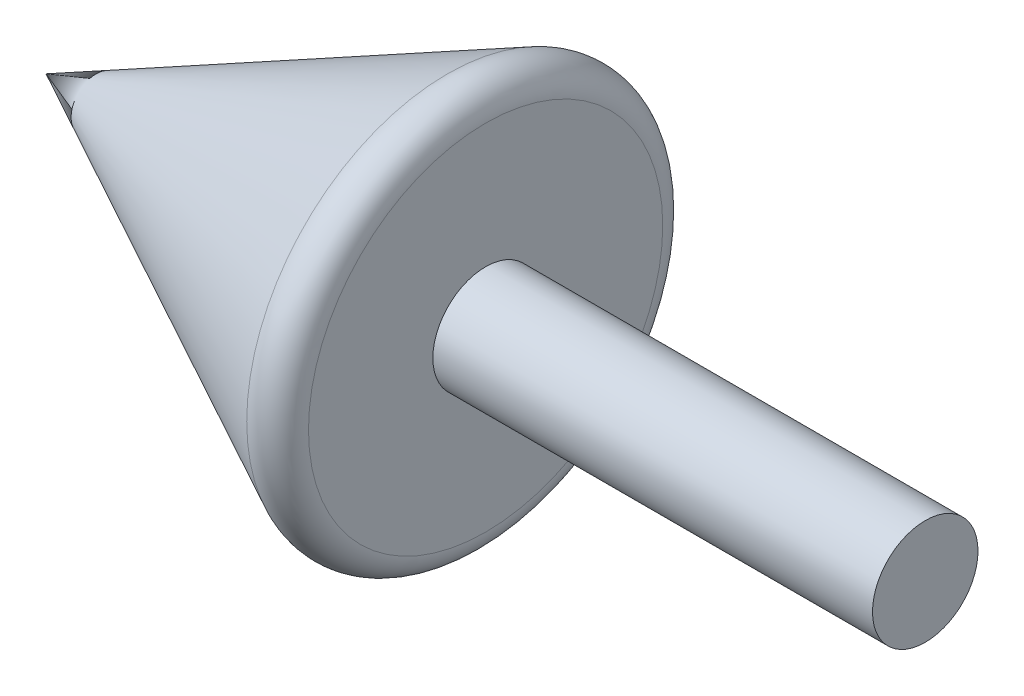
from build123d import *

# Parameters (mm, degrees)
FILLET1_R           = 3
SKETCH3_R           = 6
BOSS_EXTRUDE1_DEPTH = 50


with BuildPart() as part:
    # Sketch1 → Revolve1 (revolve)
    with BuildSketch(Plane.XY, mode=Mode.PRIVATE) as revolve1_sk:
        Polygon((0, 0), (50, 25), (50, 0), align=None)
    revolve(revolve1_sk.sketch.rotate(Axis((0, 0, 0), (1, 0, 0)), 270), axis=Axis((0, 0, 0), (1, 0, 0)))

    # Fillet1
    fillet1_edges = [part.edges().sort_by_distance(p)[0] for p in [
        (50, 0, 25),
    ]]
    fillet(fillet1_edges, radius=FILLET1_R)

    # Sketch3 → Boss-Extrude1 (add)
    with BuildSketch(Plane(origin=(50, 0, 0), x_dir=(0, 0, -1), z_dir=(1, 0, 0))):
        with Locations(Location((0, 0, 0), (0, 0, 180))):
            Circle(SKETCH3_R)
    extrude(amount=BOSS_EXTRUDE1_DEPTH)


solid = part.part
